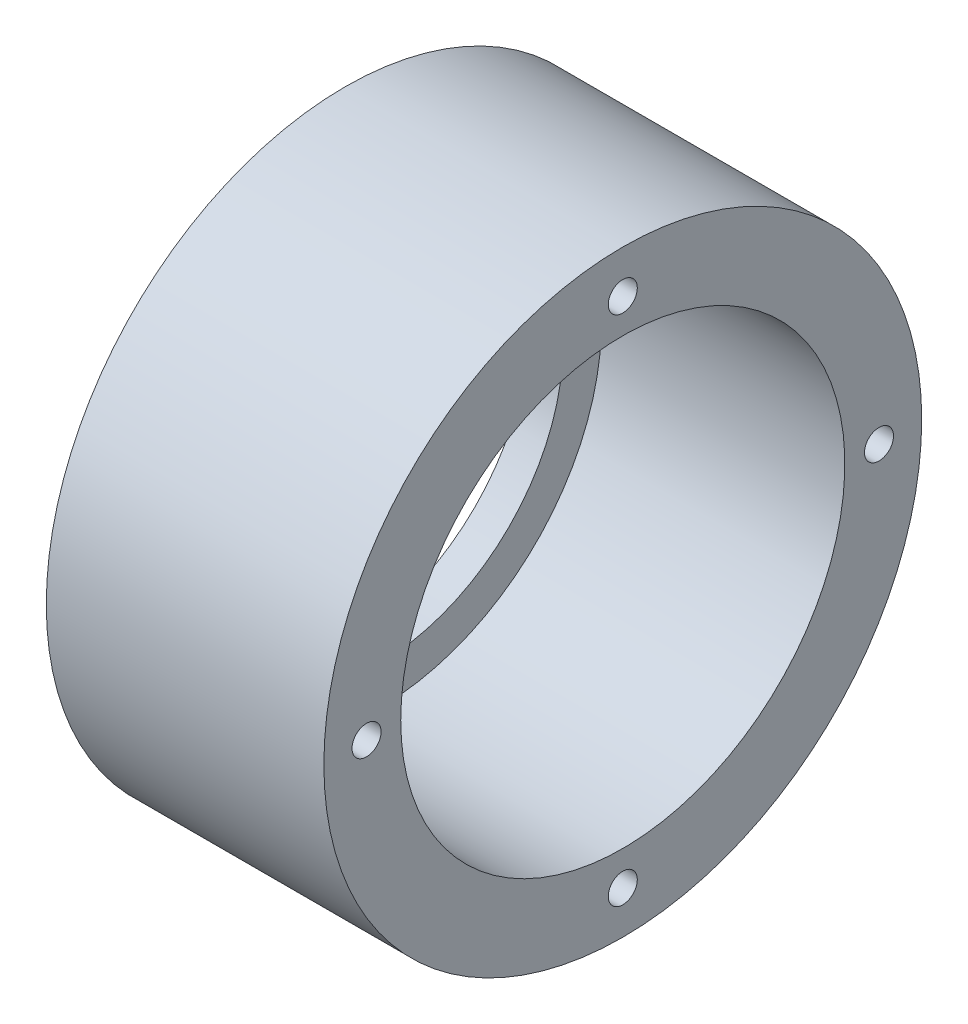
ISO-10303-21;
HEADER;
FILE_DESCRIPTION(('STEP AP214'),'2;1');
FILE_NAME('part.step','',(''),(''),'','','');
FILE_SCHEMA(('AUTOMOTIVE_DESIGN { 1 0 10303 214 1 1 1 1 }'));
ENDSEC;
DATA;
#1=APPLICATION_CONTEXT('core data for automotive mechanical design processes');
#2=APPLICATION_PROTOCOL_DEFINITION('international standard','automotive_design',2000,#1);
#3=PRODUCT_CONTEXT('',#1,'mechanical');
#4=PRODUCT('Part','Part','',(#3));
#5=PRODUCT_RELATED_PRODUCT_CATEGORY('part','',(#4));
#6=PRODUCT_DEFINITION_FORMATION('','',#4);
#7=PRODUCT_DEFINITION_CONTEXT('part definition',#1,'design');
#8=PRODUCT_DEFINITION('design','',#6,#7);
#9=PRODUCT_DEFINITION_SHAPE('','',#8);
#10=(LENGTH_UNIT() NAMED_UNIT(*) SI_UNIT(.MILLI.,.METRE.));
#11=(NAMED_UNIT(*) PLANE_ANGLE_UNIT() SI_UNIT($,.RADIAN.));
#12=(NAMED_UNIT(*) SI_UNIT($,.STERADIAN.) SOLID_ANGLE_UNIT());
#13=UNCERTAINTY_MEASURE_WITH_UNIT(LENGTH_MEASURE(1.E-05),#10,'distance_accuracy_value','');
#14=(GEOMETRIC_REPRESENTATION_CONTEXT(3) GLOBAL_UNCERTAINTY_ASSIGNED_CONTEXT((#13)) GLOBAL_UNIT_ASSIGNED_CONTEXT((#10,
#11,#12)) REPRESENTATION_CONTEXT('',''));
#15=CARTESIAN_POINT('',(0.,0.,0.));
#16=DIRECTION('',(0.,0.,1.));
#17=DIRECTION('',(1.,0.,0.));
#18=AXIS2_PLACEMENT_3D('',#15,#16,#17);
#19=CARTESIAN_POINT('',(0.,0.,0.));
#20=DIRECTION('',(-1.,0.,0.));
#21=DIRECTION('',(0.,0.,1.));
#22=AXIS2_PLACEMENT_3D('',#19,#20,#21);
#23=CYLINDRICAL_SURFACE('',#22,43.);
#24=CARTESIAN_POINT('',(8.,0.,0.));
#25=DIRECTION('',(-1.,0.,0.));
#26=DIRECTION('',(0.,0.,1.));
#27=AXIS2_PLACEMENT_3D('',#24,#25,#26);
#28=CIRCLE('',#27,43.);
#29=CARTESIAN_POINT('',(8.,0.,43.));
#30=VERTEX_POINT('',#29);
#31=EDGE_CURVE('E89',#30,#30,#28,.T.);
#32=ORIENTED_EDGE('',*,*,#31,.F.);
#33=EDGE_LOOP('',(#32));
#34=FACE_BOUND('',#33,.T.);
#35=CARTESIAN_POINT('',(0.,0.,0.));
#36=DIRECTION('',(-1.,0.,0.));
#37=DIRECTION('',(0.,0.,1.));
#38=AXIS2_PLACEMENT_3D('',#35,#36,#37);
#39=CIRCLE('',#38,43.);
#40=CARTESIAN_POINT('',(0.,0.,43.));
#41=VERTEX_POINT('',#40);
#42=EDGE_CURVE('E11',#41,#41,#39,.T.);
#43=ORIENTED_EDGE('',*,*,#42,.T.);
#44=EDGE_LOOP('',(#43));
#45=FACE_BOUND('',#44,.T.);
#46=ADVANCED_FACE('F36',(#34,#45),#23,.F.);
#47=CARTESIAN_POINT('',(0.,43.,0.));
#48=DIRECTION('',(1.,0.,0.));
#49=DIRECTION('',(0.,0.,-1.));
#50=AXIS2_PLACEMENT_3D('',#47,#48,#49);
#51=PLANE('',#50);
#52=ORIENTED_EDGE('',*,*,#42,.F.);
#53=EDGE_LOOP('',(#52));
#54=FACE_BOUND('',#53,.T.);
#55=CARTESIAN_POINT('',(0.,0.,0.));
#56=DIRECTION('',(-1.,0.,0.));
#57=DIRECTION('',(0.,0.,1.));
#58=AXIS2_PLACEMENT_3D('',#55,#56,#57);
#59=CIRCLE('',#58,70.);
#60=CARTESIAN_POINT('',(0.,0.,70.));
#61=VERTEX_POINT('',#60);
#62=EDGE_CURVE('E43',#61,#61,#59,.T.);
#63=ORIENTED_EDGE('',*,*,#62,.T.);
#64=EDGE_LOOP('',(#63));
#65=FACE_BOUND('',#64,.T.);
#66=ADVANCED_FACE('F103',(#54,#65),#51,.F.);
#67=CARTESIAN_POINT('',(0.,0.,0.));
#68=DIRECTION('',(-1.,0.,0.));
#69=DIRECTION('',(0.,0.,1.));
#70=AXIS2_PLACEMENT_3D('',#67,#68,#69);
#71=CYLINDRICAL_SURFACE('',#70,70.);
#72=ORIENTED_EDGE('',*,*,#62,.F.);
#73=EDGE_LOOP('',(#72));
#74=FACE_BOUND('',#73,.T.);
#75=CARTESIAN_POINT('',(65.,0.,0.));
#76=DIRECTION('',(-1.,0.,0.));
#77=DIRECTION('',(0.,0.,1.));
#78=AXIS2_PLACEMENT_3D('',#75,#76,#77);
#79=CIRCLE('',#78,70.);
#80=CARTESIAN_POINT('',(65.,0.,70.));
#81=VERTEX_POINT('',#80);
#82=EDGE_CURVE('E98',#81,#81,#79,.T.);
#83=ORIENTED_EDGE('',*,*,#82,.T.);
#84=EDGE_LOOP('',(#83));
#85=FACE_BOUND('',#84,.T.);
#86=ADVANCED_FACE('F105',(#74,#85),#71,.T.);
#87=CARTESIAN_POINT('',(65.,70.,0.));
#88=DIRECTION('',(-1.,0.,0.));
#89=DIRECTION('',(0.,0.,1.));
#90=AXIS2_PLACEMENT_3D('',#87,#88,#89);
#91=PLANE('',#90);
#92=CARTESIAN_POINT('',(65.,6.28466640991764E-13,60.));
#93=DIRECTION('',(1.,0.,0.));
#94=DIRECTION('',(0.,0.,-1.));
#95=AXIS2_PLACEMENT_3D('',#92,#93,#94);
#96=CIRCLE('',#95,3.4);
#97=CARTESIAN_POINT('',(65.,6.28466640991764E-13,56.6));
#98=VERTEX_POINT('',#97);
#99=EDGE_CURVE('E67',#98,#98,#96,.T.);
#100=ORIENTED_EDGE('',*,*,#99,.F.);
#101=EDGE_LOOP('',(#100));
#102=FACE_BOUND('',#101,.T.);
#103=CARTESIAN_POINT('',(65.,-60.,0.));
#104=DIRECTION('',(1.,0.,0.));
#105=DIRECTION('',(0.,0.,-1.));
#106=AXIS2_PLACEMENT_3D('',#103,#104,#105);
#107=CIRCLE('',#106,3.4);
#108=CARTESIAN_POINT('',(65.,-60.,-3.4));
#109=VERTEX_POINT('',#108);
#110=EDGE_CURVE('E66',#109,#109,#107,.T.);
#111=ORIENTED_EDGE('',*,*,#110,.F.);
#112=EDGE_LOOP('',(#111));
#113=FACE_BOUND('',#112,.T.);
#114=CARTESIAN_POINT('',(65.,-2.09488880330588E-13,-60.));
#115=DIRECTION('',(1.,0.,0.));
#116=DIRECTION('',(0.,0.,-1.));
#117=AXIS2_PLACEMENT_3D('',#114,#115,#116);
#118=CIRCLE('',#117,3.4);
#119=CARTESIAN_POINT('',(65.,-2.09488880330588E-13,-63.4));
#120=VERTEX_POINT('',#119);
#121=EDGE_CURVE('E77',#120,#120,#118,.T.);
#122=ORIENTED_EDGE('',*,*,#121,.F.);
#123=EDGE_LOOP('',(#122));
#124=FACE_BOUND('',#123,.T.);
#125=CARTESIAN_POINT('',(65.,60.,0.));
#126=DIRECTION('',(1.,0.,0.));
#127=DIRECTION('',(0.,0.,-1.));
#128=AXIS2_PLACEMENT_3D('',#125,#126,#127);
#129=CIRCLE('',#128,3.4);
#130=CARTESIAN_POINT('',(65.,60.,-3.4));
#131=VERTEX_POINT('',#130);
#132=EDGE_CURVE('E83',#131,#131,#129,.T.);
#133=ORIENTED_EDGE('',*,*,#132,.F.);
#134=EDGE_LOOP('',(#133));
#135=FACE_BOUND('',#134,.T.);
#136=ORIENTED_EDGE('',*,*,#82,.F.);
#137=EDGE_LOOP('',(#136));
#138=FACE_BOUND('',#137,.T.);
#139=CARTESIAN_POINT('',(65.,0.,0.));
#140=DIRECTION('',(-1.,0.,0.));
#141=DIRECTION('',(0.,0.,1.));
#142=AXIS2_PLACEMENT_3D('',#139,#140,#141);
#143=CIRCLE('',#142,52.);
#144=CARTESIAN_POINT('',(65.,0.,52.));
#145=VERTEX_POINT('',#144);
#146=EDGE_CURVE('E95',#145,#145,#143,.T.);
#147=ORIENTED_EDGE('',*,*,#146,.T.);
#148=EDGE_LOOP('',(#147));
#149=FACE_BOUND('',#148,.T.);
#150=ADVANCED_FACE('F108',(#102,#113,#124,#135,#138,#149),#91,.F.);
#151=CARTESIAN_POINT('',(0.,0.,0.));
#152=DIRECTION('',(-1.,0.,0.));
#153=DIRECTION('',(0.,0.,1.));
#154=AXIS2_PLACEMENT_3D('',#151,#152,#153);
#155=CYLINDRICAL_SURFACE('',#154,52.);
#156=ORIENTED_EDGE('',*,*,#146,.F.);
#157=EDGE_LOOP('',(#156));
#158=FACE_BOUND('',#157,.T.);
#159=CARTESIAN_POINT('',(8.,0.,0.));
#160=DIRECTION('',(-1.,0.,0.));
#161=DIRECTION('',(0.,0.,1.));
#162=AXIS2_PLACEMENT_3D('',#159,#160,#161);
#163=CIRCLE('',#162,52.);
#164=CARTESIAN_POINT('',(8.,0.,52.));
#165=VERTEX_POINT('',#164);
#166=EDGE_CURVE('E92',#165,#165,#163,.T.);
#167=ORIENTED_EDGE('',*,*,#166,.T.);
#168=EDGE_LOOP('',(#167));
#169=FACE_BOUND('',#168,.T.);
#170=ADVANCED_FACE('F114',(#158,#169),#155,.F.);
#171=CARTESIAN_POINT('',(8.,52.,0.));
#172=DIRECTION('',(-1.,0.,0.));
#173=DIRECTION('',(0.,0.,1.));
#174=AXIS2_PLACEMENT_3D('',#171,#172,#173);
#175=PLANE('',#174);
#176=ORIENTED_EDGE('',*,*,#166,.F.);
#177=EDGE_LOOP('',(#176));
#178=FACE_BOUND('',#177,.T.);
#179=ORIENTED_EDGE('',*,*,#31,.T.);
#180=EDGE_LOOP('',(#179));
#181=FACE_BOUND('',#180,.T.);
#182=ADVANCED_FACE('F121',(#178,#181),#175,.F.);
#183=CARTESIAN_POINT('',(43.,60.,0.));
#184=DIRECTION('',(1.,0.,0.));
#185=DIRECTION('',(0.,0.,-1.));
#186=AXIS2_PLACEMENT_3D('',#183,#184,#185);
#187=CONICAL_SURFACE('',#186,3.4,1.02974425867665);
#188=CARTESIAN_POINT('',(40.9570738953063,60.,0.));
#189=VERTEX_POINT('',#188);
#190=VERTEX_LOOP('',#189);
#191=FACE_BOUND('',#190,.T.);
#192=CARTESIAN_POINT('',(43.,60.,0.));
#193=DIRECTION('',(1.,0.,0.));
#194=DIRECTION('',(0.,0.,-1.));
#195=AXIS2_PLACEMENT_3D('',#192,#193,#194);
#196=CIRCLE('',#195,3.4);
#197=CARTESIAN_POINT('',(43.,60.,-3.4));
#198=VERTEX_POINT('',#197);
#199=EDGE_CURVE('E86',#198,#198,#196,.T.);
#200=ORIENTED_EDGE('',*,*,#199,.T.);
#201=EDGE_LOOP('',(#200));
#202=FACE_BOUND('',#201,.T.);
#203=ADVANCED_FACE('F127',(#191,#202),#187,.F.);
#204=CARTESIAN_POINT('',(65.,60.,0.));
#205=DIRECTION('',(1.,0.,0.));
#206=DIRECTION('',(0.,0.,-1.));
#207=AXIS2_PLACEMENT_3D('',#204,#205,#206);
#208=CYLINDRICAL_SURFACE('',#207,3.4);
#209=ORIENTED_EDGE('',*,*,#199,.F.);
#210=EDGE_LOOP('',(#209));
#211=FACE_BOUND('',#210,.T.);
#212=ORIENTED_EDGE('',*,*,#132,.T.);
#213=EDGE_LOOP('',(#212));
#214=FACE_BOUND('',#213,.T.);
#215=ADVANCED_FACE('F141',(#211,#214),#208,.F.);
#216=CARTESIAN_POINT('',(43.,-2.09488880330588E-13,-60.));
#217=DIRECTION('',(1.,0.,0.));
#218=DIRECTION('',(0.,0.,-1.));
#219=AXIS2_PLACEMENT_3D('',#216,#217,#218);
#220=CONICAL_SURFACE('',#219,3.39999999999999,1.02974425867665);
#221=CARTESIAN_POINT('',(40.9570738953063,-2.1564704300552E-13,-60.));
#222=VERTEX_POINT('',#221);
#223=VERTEX_LOOP('',#222);
#224=FACE_BOUND('',#223,.T.);
#225=CARTESIAN_POINT('',(43.,-2.09488880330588E-13,-60.));
#226=DIRECTION('',(1.,0.,0.));
#227=DIRECTION('',(0.,0.,-1.));
#228=AXIS2_PLACEMENT_3D('',#225,#226,#227);
#229=CIRCLE('',#228,3.39999999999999);
#230=CARTESIAN_POINT('',(43.,-2.09488880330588E-13,-63.4));
#231=VERTEX_POINT('',#230);
#232=EDGE_CURVE('E80',#231,#231,#229,.T.);
#233=ORIENTED_EDGE('',*,*,#232,.T.);
#234=EDGE_LOOP('',(#233));
#235=FACE_BOUND('',#234,.T.);
#236=ADVANCED_FACE('F144',(#224,#235),#220,.F.);
#237=CARTESIAN_POINT('',(65.,-2.09488880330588E-13,-60.));
#238=DIRECTION('',(1.,0.,0.));
#239=DIRECTION('',(0.,0.,-1.));
#240=AXIS2_PLACEMENT_3D('',#237,#238,#239);
#241=CYLINDRICAL_SURFACE('',#240,3.4);
#242=ORIENTED_EDGE('',*,*,#232,.F.);
#243=EDGE_LOOP('',(#242));
#244=FACE_BOUND('',#243,.T.);
#245=ORIENTED_EDGE('',*,*,#121,.T.);
#246=EDGE_LOOP('',(#245));
#247=FACE_BOUND('',#246,.T.);
#248=ADVANCED_FACE('F148',(#244,#247),#241,.F.);
#249=CARTESIAN_POINT('',(43.,-60.,0.));
#250=DIRECTION('',(1.,0.,0.));
#251=DIRECTION('',(0.,0.,-1.));
#252=AXIS2_PLACEMENT_3D('',#249,#250,#251);
#253=CONICAL_SURFACE('',#252,3.39999999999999,1.02974425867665);
#254=CARTESIAN_POINT('',(40.9570738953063,-60.,0.));
#255=VERTEX_POINT('',#254);
#256=VERTEX_LOOP('',#255);
#257=FACE_BOUND('',#256,.T.);
#258=CARTESIAN_POINT('',(43.,-60.,0.));
#259=DIRECTION('',(1.,0.,0.));
#260=DIRECTION('',(0.,0.,-1.));
#261=AXIS2_PLACEMENT_3D('',#258,#259,#260);
#262=CIRCLE('',#261,3.39999999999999);
#263=CARTESIAN_POINT('',(43.,-60.,-3.39999999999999));
#264=VERTEX_POINT('',#263);
#265=EDGE_CURVE('E70',#264,#264,#262,.T.);
#266=ORIENTED_EDGE('',*,*,#265,.T.);
#267=EDGE_LOOP('',(#266));
#268=FACE_BOUND('',#267,.T.);
#269=ADVANCED_FACE('F151',(#257,#268),#253,.F.);
#270=CARTESIAN_POINT('',(65.,-60.,0.));
#271=DIRECTION('',(1.,0.,0.));
#272=DIRECTION('',(0.,0.,-1.));
#273=AXIS2_PLACEMENT_3D('',#270,#271,#272);
#274=CYLINDRICAL_SURFACE('',#273,3.4);
#275=ORIENTED_EDGE('',*,*,#265,.F.);
#276=EDGE_LOOP('',(#275));
#277=FACE_BOUND('',#276,.T.);
#278=ORIENTED_EDGE('',*,*,#110,.T.);
#279=EDGE_LOOP('',(#278));
#280=FACE_BOUND('',#279,.T.);
#281=ADVANCED_FACE('F60',(#277,#280),#274,.F.);
#282=CARTESIAN_POINT('',(43.,6.28466640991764E-13,60.));
#283=DIRECTION('',(1.,0.,0.));
#284=DIRECTION('',(0.,0.,-1.));
#285=AXIS2_PLACEMENT_3D('',#282,#283,#284);
#286=CONICAL_SURFACE('',#285,3.39999999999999,1.02974425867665);
#287=CARTESIAN_POINT('',(40.9570738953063,6.22308478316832E-13,60.));
#288=VERTEX_POINT('',#287);
#289=VERTEX_LOOP('',#288);
#290=FACE_BOUND('',#289,.T.);
#291=CARTESIAN_POINT('',(43.,6.28466640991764E-13,60.));
#292=DIRECTION('',(1.,0.,0.));
#293=DIRECTION('',(0.,0.,-1.));
#294=AXIS2_PLACEMENT_3D('',#291,#292,#293);
#295=CIRCLE('',#294,3.39999999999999);
#296=CARTESIAN_POINT('',(43.,6.28466640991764E-13,56.6));
#297=VERTEX_POINT('',#296);
#298=EDGE_CURVE('E64',#297,#297,#295,.T.);
#299=ORIENTED_EDGE('',*,*,#298,.T.);
#300=EDGE_LOOP('',(#299));
#301=FACE_BOUND('',#300,.T.);
#302=ADVANCED_FACE('F56',(#290,#301),#286,.F.);
#303=CARTESIAN_POINT('',(65.,6.28466640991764E-13,60.));
#304=DIRECTION('',(1.,0.,0.));
#305=DIRECTION('',(0.,0.,-1.));
#306=AXIS2_PLACEMENT_3D('',#303,#304,#305);
#307=CYLINDRICAL_SURFACE('',#306,3.4);
#308=ORIENTED_EDGE('',*,*,#298,.F.);
#309=EDGE_LOOP('',(#308));
#310=FACE_BOUND('',#309,.T.);
#311=ORIENTED_EDGE('',*,*,#99,.T.);
#312=EDGE_LOOP('',(#311));
#313=FACE_BOUND('',#312,.T.);
#314=ADVANCED_FACE('F59',(#310,#313),#307,.F.);
#315=CLOSED_SHELL('',(#46,#66,#86,#150,#170,#182,#203,#215,#236,#248,#269,#281,#302,#314));
#316=MANIFOLD_SOLID_BREP('B2',#315);
#317=ADVANCED_BREP_SHAPE_REPRESENTATION('',(#18,#316),#14);
#318=SHAPE_DEFINITION_REPRESENTATION(#9,#317);
ENDSEC;
END-ISO-10303-21;
